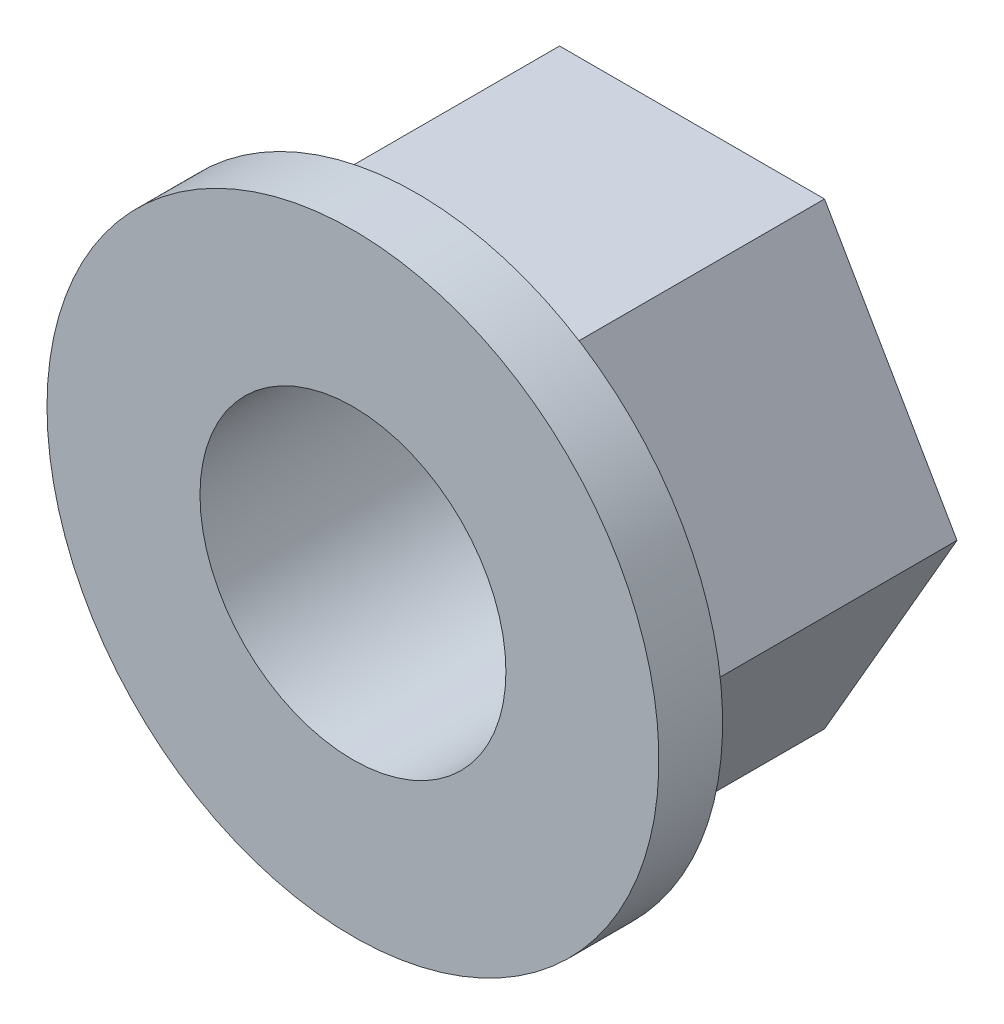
ISO-10303-21;
HEADER;
FILE_DESCRIPTION(('STEP AP214'),'2;1');
FILE_NAME('part.step','',(''),(''),'','','');
FILE_SCHEMA(('AUTOMOTIVE_DESIGN { 1 0 10303 214 1 1 1 1 }'));
ENDSEC;
DATA;
#1=APPLICATION_CONTEXT('core data for automotive mechanical design processes');
#2=APPLICATION_PROTOCOL_DEFINITION('international standard','automotive_design',2000,#1);
#3=PRODUCT_CONTEXT('',#1,'mechanical');
#4=PRODUCT('Part','Part','',(#3));
#5=PRODUCT_RELATED_PRODUCT_CATEGORY('part','',(#4));
#6=PRODUCT_DEFINITION_FORMATION('','',#4);
#7=PRODUCT_DEFINITION_CONTEXT('part definition',#1,'design');
#8=PRODUCT_DEFINITION('design','',#6,#7);
#9=PRODUCT_DEFINITION_SHAPE('','',#8);
#10=(LENGTH_UNIT() NAMED_UNIT(*) SI_UNIT(.MILLI.,.METRE.));
#11=(NAMED_UNIT(*) PLANE_ANGLE_UNIT() SI_UNIT($,.RADIAN.));
#12=(NAMED_UNIT(*) SI_UNIT($,.STERADIAN.) SOLID_ANGLE_UNIT());
#13=UNCERTAINTY_MEASURE_WITH_UNIT(LENGTH_MEASURE(1.E-05),#10,'distance_accuracy_value','');
#14=(GEOMETRIC_REPRESENTATION_CONTEXT(3) GLOBAL_UNCERTAINTY_ASSIGNED_CONTEXT((#13)) GLOBAL_UNIT_ASSIGNED_CONTEXT((#10,
#11,#12)) REPRESENTATION_CONTEXT('',''));
#15=CARTESIAN_POINT('',(0.,0.,0.));
#16=DIRECTION('',(0.,0.,1.));
#17=DIRECTION('',(1.,0.,0.));
#18=AXIS2_PLACEMENT_3D('',#15,#16,#17);
#19=CARTESIAN_POINT('',(-5.19615242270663,9.,-13.3));
#20=DIRECTION('',(-0.866025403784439,0.5,0.));
#21=DIRECTION('',(0.,0.,-1.));
#22=AXIS2_PLACEMENT_3D('',#19,#20,#21);
#23=PLANE('',#22);
#24=DIRECTION('',(0.,0.,1.));
#25=VECTOR('',#24,1.);
#26=CARTESIAN_POINT('',(-10.3923048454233,-1.00010690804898E-11,-13.30000000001));
#27=LINE('',#26,#25);
#28=CARTESIAN_POINT('',(-10.3923048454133,0.,-13.3));
#29=VERTEX_POINT('',#28);
#30=CARTESIAN_POINT('',(-10.3923048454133,0.,-2.5));
#31=VERTEX_POINT('',#30);
#32=EDGE_CURVE('E83',#29,#31,#27,.T.);
#33=ORIENTED_EDGE('',*,*,#32,.T.);
#34=DIRECTION('',(0.5,0.866025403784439,0.));
#35=VECTOR('',#34,1.);
#36=CARTESIAN_POINT('',(-5.19615242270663,9.,-2.5));
#37=LINE('',#36,#35);
#38=CARTESIAN_POINT('',(-5.19615242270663,9.,-2.5));
#39=VERTEX_POINT('',#38);
#40=EDGE_CURVE('E71',#39,#31,#37,.F.);
#41=ORIENTED_EDGE('',*,*,#40,.F.);
#42=DIRECTION('',(0.,0.,1.));
#43=VECTOR('',#42,1.);
#44=CARTESIAN_POINT('',(-5.19615242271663,9.00000000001,-13.30000000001));
#45=LINE('',#44,#43);
#46=CARTESIAN_POINT('',(-5.19615242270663,9.,-13.3));
#47=VERTEX_POINT('',#46);
#48=EDGE_CURVE('E101',#47,#39,#45,.T.);
#49=ORIENTED_EDGE('',*,*,#48,.F.);
#50=DIRECTION('',(0.5,0.866025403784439,0.));
#51=VECTOR('',#50,1.);
#52=CARTESIAN_POINT('',(-5.19615242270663,9.,-13.3));
#53=LINE('',#52,#51);
#54=EDGE_CURVE('E88',#29,#47,#53,.T.);
#55=ORIENTED_EDGE('',*,*,#54,.F.);
#56=EDGE_LOOP('',(#33,#41,#49,#55));
#57=FACE_BOUND('',#56,.T.);
#58=ADVANCED_FACE('F14',(#57),#23,.T.);
#59=CARTESIAN_POINT('',(5.19615242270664,-9.,-13.3));
#60=DIRECTION('',(0.866025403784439,-0.5,0.));
#61=DIRECTION('',(-0.5,-0.866025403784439,0.));
#62=AXIS2_PLACEMENT_3D('',#59,#60,#61);
#63=PLANE('',#62);
#64=DIRECTION('',(0.,0.,1.));
#65=VECTOR('',#64,1.);
#66=CARTESIAN_POINT('',(10.3923048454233,1.00005007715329E-11,-13.30000000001));
#67=LINE('',#66,#65);
#68=CARTESIAN_POINT('',(10.3923048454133,0.,-13.3));
#69=VERTEX_POINT('',#68);
#70=CARTESIAN_POINT('',(10.3923048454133,0.,-2.5));
#71=VERTEX_POINT('',#70);
#72=EDGE_CURVE('E98',#69,#71,#67,.T.);
#73=ORIENTED_EDGE('',*,*,#72,.T.);
#74=DIRECTION('',(-0.5,-0.866025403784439,0.));
#75=VECTOR('',#74,1.);
#76=CARTESIAN_POINT('',(5.19615242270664,-9.,-2.5));
#77=LINE('',#76,#75);
#78=CARTESIAN_POINT('',(5.19615242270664,-9.,-2.5));
#79=VERTEX_POINT('',#78);
#80=EDGE_CURVE('E111',#79,#71,#77,.F.);
#81=ORIENTED_EDGE('',*,*,#80,.F.);
#82=DIRECTION('',(0.,0.,1.));
#83=VECTOR('',#82,1.);
#84=CARTESIAN_POINT('',(5.19615242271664,-9.00000000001,-13.30000000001));
#85=LINE('',#84,#83);
#86=CARTESIAN_POINT('',(5.19615242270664,-9.,-13.3));
#87=VERTEX_POINT('',#86);
#88=EDGE_CURVE('E39',#87,#79,#85,.T.);
#89=ORIENTED_EDGE('',*,*,#88,.F.);
#90=DIRECTION('',(0.5,0.866025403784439,0.));
#91=VECTOR('',#90,1.);
#92=CARTESIAN_POINT('',(0.,-18.,-13.3));
#93=LINE('',#92,#91);
#94=EDGE_CURVE('E23',#87,#69,#93,.T.);
#95=ORIENTED_EDGE('',*,*,#94,.T.);
#96=EDGE_LOOP('',(#73,#81,#89,#95));
#97=FACE_BOUND('',#96,.T.);
#98=ADVANCED_FACE('F159',(#97),#63,.T.);
#99=CARTESIAN_POINT('',(-5.19615242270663,-9.,-13.3));
#100=DIRECTION('',(0.,-1.,0.));
#101=DIRECTION('',(0.,0.,1.));
#102=AXIS2_PLACEMENT_3D('',#99,#100,#101);
#103=PLANE('',#102);
#104=ORIENTED_EDGE('',*,*,#88,.T.);
#105=DIRECTION('',(-1.,0.,0.));
#106=VECTOR('',#105,1.);
#107=CARTESIAN_POINT('',(-5.19615242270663,-9.,-2.5));
#108=LINE('',#107,#106);
#109=CARTESIAN_POINT('',(-5.19615242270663,-9.,-2.5));
#110=VERTEX_POINT('',#109);
#111=EDGE_CURVE('E114',#110,#79,#108,.F.);
#112=ORIENTED_EDGE('',*,*,#111,.F.);
#113=DIRECTION('',(0.,0.,1.));
#114=VECTOR('',#113,1.);
#115=CARTESIAN_POINT('',(-5.19615242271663,-9.00000000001,-13.30000000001));
#116=LINE('',#115,#114);
#117=CARTESIAN_POINT('',(-5.19615242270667,-9.,-13.3));
#118=VERTEX_POINT('',#117);
#119=EDGE_CURVE('E85',#118,#110,#116,.T.);
#120=ORIENTED_EDGE('',*,*,#119,.F.);
#121=DIRECTION('',(1.,0.,0.));
#122=VECTOR('',#121,1.);
#123=CARTESIAN_POINT('',(0.,-9.,-13.3));
#124=LINE('',#123,#122);
#125=EDGE_CURVE('E9',#118,#87,#124,.T.);
#126=ORIENTED_EDGE('',*,*,#125,.T.);
#127=EDGE_LOOP('',(#104,#112,#120,#126));
#128=FACE_BOUND('',#127,.T.);
#129=ADVANCED_FACE('F154',(#128),#103,.T.);
#130=CARTESIAN_POINT('',(10.3923048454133,0.,-13.3));
#131=DIRECTION('',(0.866025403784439,0.5,0.));
#132=DIRECTION('',(0.,0.,-1.));
#133=AXIS2_PLACEMENT_3D('',#130,#131,#132);
#134=PLANE('',#133);
#135=DIRECTION('',(0.,0.,1.));
#136=VECTOR('',#135,1.);
#137=CARTESIAN_POINT('',(5.19615242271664,9.00000000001,-13.30000000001));
#138=LINE('',#137,#136);
#139=CARTESIAN_POINT('',(5.19615242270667,9.,-13.3));
#140=VERTEX_POINT('',#139);
#141=CARTESIAN_POINT('',(5.19615242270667,9.,-2.5));
#142=VERTEX_POINT('',#141);
#143=EDGE_CURVE('E106',#140,#142,#138,.T.);
#144=ORIENTED_EDGE('',*,*,#143,.T.);
#145=DIRECTION('',(0.5,-0.866025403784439,0.));
#146=VECTOR('',#145,1.);
#147=CARTESIAN_POINT('',(10.3923048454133,0.,-2.5));
#148=LINE('',#147,#146);
#149=EDGE_CURVE('E109',#71,#142,#148,.F.);
#150=ORIENTED_EDGE('',*,*,#149,.F.);
#151=ORIENTED_EDGE('',*,*,#72,.F.);
#152=DIRECTION('',(-0.5,0.866025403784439,0.));
#153=VECTOR('',#152,1.);
#154=CARTESIAN_POINT('',(15.5884572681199,-9.,-13.3));
#155=LINE('',#154,#153);
#156=EDGE_CURVE('E119',#69,#140,#155,.T.);
#157=ORIENTED_EDGE('',*,*,#156,.T.);
#158=EDGE_LOOP('',(#144,#150,#151,#157));
#159=FACE_BOUND('',#158,.T.);
#160=ADVANCED_FACE('F167',(#159),#134,.T.);
#161=CARTESIAN_POINT('',(0.,0.,-27.5375057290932));
#162=DIRECTION('',(0.,0.,-1.));
#163=DIRECTION('',(0.,1.,0.));
#164=AXIS2_PLACEMENT_3D('',#161,#162,#163);
#165=CYLINDRICAL_SURFACE('',#164,6.);
#166=CARTESIAN_POINT('',(0.,0.,-13.30000000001));
#167=DIRECTION('',(0.,0.,-1.));
#168=DIRECTION('',(0.,1.,0.));
#169=AXIS2_PLACEMENT_3D('',#166,#167,#168);
#170=CIRCLE('',#169,6.);
#171=CARTESIAN_POINT('',(0.,6.,-13.30000000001));
#172=VERTEX_POINT('',#171);
#173=EDGE_CURVE('E90',#172,#172,#170,.T.);
#174=ORIENTED_EDGE('',*,*,#173,.T.);
#175=EDGE_LOOP('',(#174));
#176=FACE_BOUND('',#175,.T.);
#177=CARTESIAN_POINT('',(0.,0.,0.));
#178=DIRECTION('',(0.,0.,1.));
#179=DIRECTION('',(1.,0.,0.));
#180=AXIS2_PLACEMENT_3D('',#177,#178,#179);
#181=CIRCLE('',#180,6.);
#182=CARTESIAN_POINT('',(6.,0.,0.));
#183=VERTEX_POINT('',#182);
#184=EDGE_CURVE('E125',#183,#183,#181,.T.);
#185=ORIENTED_EDGE('',*,*,#184,.T.);
#186=EDGE_LOOP('',(#185));
#187=FACE_BOUND('',#186,.T.);
#188=ADVANCED_FACE('F191',(#176,#187),#165,.F.);
#189=CARTESIAN_POINT('',(0.,-18.,-13.3));
#190=DIRECTION('',(0.,0.,1.));
#191=DIRECTION('',(0.,1.,0.));
#192=AXIS2_PLACEMENT_3D('',#189,#190,#191);
#193=PLANE('',#192);
#194=ORIENTED_EDGE('',*,*,#173,.F.);
#195=EDGE_LOOP('',(#194));
#196=FACE_BOUND('',#195,.T.);
#197=ORIENTED_EDGE('',*,*,#125,.F.);
#198=DIRECTION('',(-0.5,0.866025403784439,0.));
#199=VECTOR('',#198,1.);
#200=CARTESIAN_POINT('',(-10.3923048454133,0.,-13.3));
#201=LINE('',#200,#199);
#202=EDGE_CURVE('E31',#118,#29,#201,.T.);
#203=ORIENTED_EDGE('',*,*,#202,.T.);
#204=ORIENTED_EDGE('',*,*,#54,.T.);
#205=DIRECTION('',(-1.,0.,0.));
#206=VECTOR('',#205,1.);
#207=CARTESIAN_POINT('',(-5.19615242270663,9.,-13.3));
#208=LINE('',#207,#206);
#209=EDGE_CURVE('E116',#47,#140,#208,.F.);
#210=ORIENTED_EDGE('',*,*,#209,.T.);
#211=ORIENTED_EDGE('',*,*,#156,.F.);
#212=ORIENTED_EDGE('',*,*,#94,.F.);
#213=EDGE_LOOP('',(#197,#203,#204,#210,#211,#212));
#214=FACE_BOUND('',#213,.T.);
#215=ADVANCED_FACE('F157',(#196,#214),#193,.F.);
#216=CARTESIAN_POINT('',(-10.3923048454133,0.,-13.3));
#217=DIRECTION('',(-0.866025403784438,-0.5,0.));
#218=DIRECTION('',(0.,0.,1.));
#219=AXIS2_PLACEMENT_3D('',#216,#217,#218);
#220=PLANE('',#219);
#221=ORIENTED_EDGE('',*,*,#119,.T.);
#222=DIRECTION('',(0.5,-0.866025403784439,0.));
#223=VECTOR('',#222,1.);
#224=CARTESIAN_POINT('',(0.,-18.,-2.5));
#225=LINE('',#224,#223);
#226=EDGE_CURVE('E75',#110,#31,#225,.F.);
#227=ORIENTED_EDGE('',*,*,#226,.T.);
#228=ORIENTED_EDGE('',*,*,#32,.F.);
#229=ORIENTED_EDGE('',*,*,#202,.F.);
#230=EDGE_LOOP('',(#221,#227,#228,#229));
#231=FACE_BOUND('',#230,.T.);
#232=ADVANCED_FACE('F82',(#231),#220,.T.);
#233=CARTESIAN_POINT('',(-5.19615242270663,9.,-13.3));
#234=DIRECTION('',(0.,-1.,0.));
#235=DIRECTION('',(0.,0.,1.));
#236=AXIS2_PLACEMENT_3D('',#233,#234,#235);
#237=PLANE('',#236);
#238=DIRECTION('',(-1.,0.,0.));
#239=VECTOR('',#238,1.);
#240=CARTESIAN_POINT('',(-5.19615242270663,9.,-2.5));
#241=LINE('',#240,#239);
#242=EDGE_CURVE('E77',#142,#39,#241,.T.);
#243=ORIENTED_EDGE('',*,*,#242,.F.);
#244=ORIENTED_EDGE('',*,*,#143,.F.);
#245=ORIENTED_EDGE('',*,*,#209,.F.);
#246=ORIENTED_EDGE('',*,*,#48,.T.);
#247=EDGE_LOOP('',(#243,#244,#245,#246));
#248=FACE_BOUND('',#247,.T.);
#249=ADVANCED_FACE('F179',(#248),#237,.F.);
#250=CARTESIAN_POINT('',(0.,6.75,0.));
#251=DIRECTION('',(0.,0.,-1.));
#252=DIRECTION('',(-1.,0.,0.));
#253=AXIS2_PLACEMENT_3D('',#250,#251,#252);
#254=PLANE('',#253);
#255=CARTESIAN_POINT('',(0.,0.,0.));
#256=DIRECTION('',(0.,0.,-1.));
#257=DIRECTION('',(-1.,0.,0.));
#258=AXIS2_PLACEMENT_3D('',#255,#256,#257);
#259=CIRCLE('',#258,12.);
#260=CARTESIAN_POINT('',(-12.,0.,0.));
#261=VERTEX_POINT('',#260);
#262=EDGE_CURVE('E127',#261,#261,#259,.T.);
#263=ORIENTED_EDGE('',*,*,#262,.F.);
#264=EDGE_LOOP('',(#263));
#265=FACE_BOUND('',#264,.T.);
#266=ORIENTED_EDGE('',*,*,#184,.F.);
#267=EDGE_LOOP('',(#266));
#268=FACE_BOUND('',#267,.T.);
#269=ADVANCED_FACE('F170',(#265,#268),#254,.F.);
#270=CARTESIAN_POINT('',(0.,0.,-34.925));
#271=DIRECTION('',(0.,0.,1.));
#272=DIRECTION('',(-1.,0.,0.));
#273=AXIS2_PLACEMENT_3D('',#270,#271,#272);
#274=CYLINDRICAL_SURFACE('',#273,12.);
#275=ORIENTED_EDGE('',*,*,#262,.T.);
#276=EDGE_LOOP('',(#275));
#277=FACE_BOUND('',#276,.T.);
#278=CARTESIAN_POINT('',(0.,0.,-2.50000000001));
#279=DIRECTION('',(0.,0.,-1.));
#280=DIRECTION('',(-1.,0.,0.));
#281=AXIS2_PLACEMENT_3D('',#278,#279,#280);
#282=CIRCLE('',#281,12.);
#283=CARTESIAN_POINT('',(-12.,0.,-2.50000000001));
#284=VERTEX_POINT('',#283);
#285=EDGE_CURVE('E18',#284,#284,#282,.T.);
#286=ORIENTED_EDGE('',*,*,#285,.F.);
#287=EDGE_LOOP('',(#286));
#288=FACE_BOUND('',#287,.T.);
#289=ADVANCED_FACE('F172',(#277,#288),#274,.T.);
#290=CARTESIAN_POINT('',(0.,12.,-2.5));
#291=DIRECTION('',(0.,0.,1.));
#292=DIRECTION('',(0.,1.,0.));
#293=AXIS2_PLACEMENT_3D('',#290,#291,#292);
#294=PLANE('',#293);
#295=ORIENTED_EDGE('',*,*,#226,.F.);
#296=ORIENTED_EDGE('',*,*,#111,.T.);
#297=ORIENTED_EDGE('',*,*,#80,.T.);
#298=ORIENTED_EDGE('',*,*,#149,.T.);
#299=ORIENTED_EDGE('',*,*,#242,.T.);
#300=ORIENTED_EDGE('',*,*,#40,.T.);
#301=EDGE_LOOP('',(#295,#296,#297,#298,#299,#300));
#302=FACE_BOUND('',#301,.T.);
#303=ORIENTED_EDGE('',*,*,#285,.T.);
#304=EDGE_LOOP('',(#303));
#305=FACE_BOUND('',#304,.T.);
#306=ADVANCED_FACE('F16',(#302,#305),#294,.F.);
#307=CLOSED_SHELL('',(#58,#98,#129,#160,#188,#215,#232,#249,#269,#289,#306));
#308=MANIFOLD_SOLID_BREP('B1',#307);
#309=ADVANCED_BREP_SHAPE_REPRESENTATION('',(#18,#308),#14);
#310=SHAPE_DEFINITION_REPRESENTATION(#9,#309);
ENDSEC;
END-ISO-10303-21;
